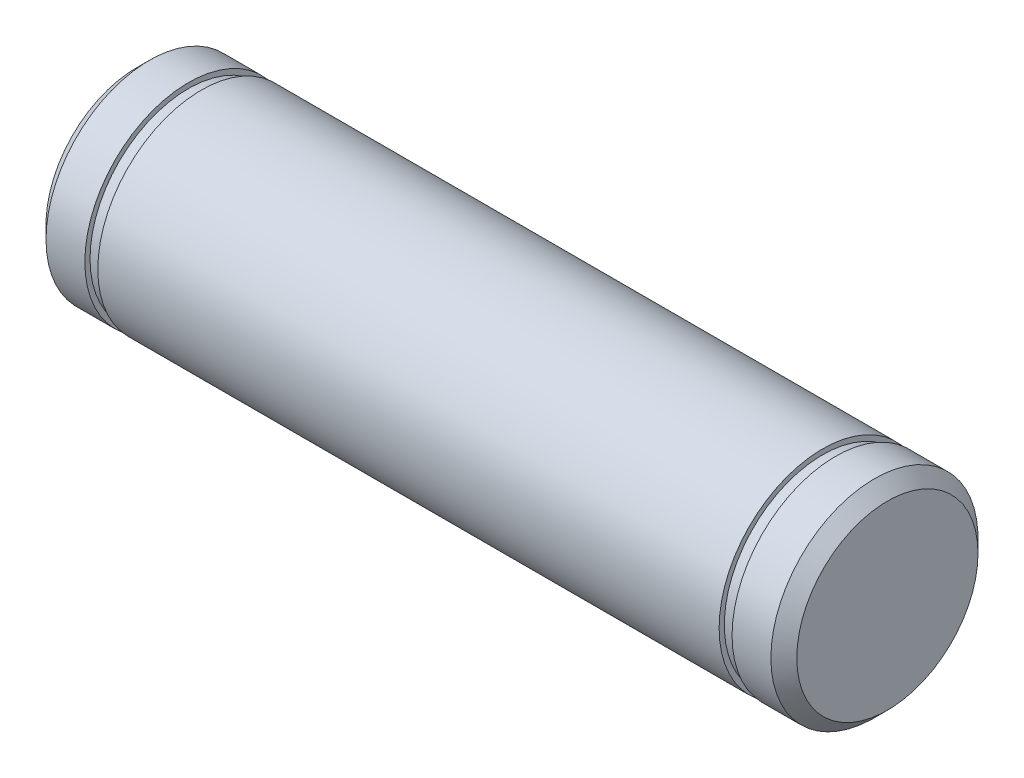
from build123d import *

# Parameters (mm, degrees)
SKETCH1_R           = 2
BOSS_EXTRUDE1_DEPTH = 14.5
CUT_EXTRUDE2_START  = -1
SKETCH2_R           = 2.498108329
SKETCH2_R_2         = 1.9
CUT_EXTRUDE2_DEPTH  = 0.25
CUT_EXTRUDE3_START  = -1.25
SKETCH3_R           = 2.5
SKETCH3_R_2         = 1.9
CUT_EXTRUDE3_DEPTH  = 0.25
CHAMFER1_SIZE       = 0.25


with BuildPart() as part:
    # Sketch1 → Boss-Extrude1 (new body)
    with BuildSketch(Plane(origin=(0, 0, 0), x_dir=(0, 0, -1), z_dir=(1, 0, 0))):
        with Locations(Location((0, 0, 0), (0, 0, 180))):
            Circle(SKETCH1_R)
    extrude(amount=BOSS_EXTRUDE1_DEPTH)

    # Sketch2 → Cut-Extrude2 (cut)
    with BuildSketch(Plane(origin=(14.5, 0, 0), x_dir=(0, 0, -1), z_dir=(1, 0, 0)).offset(CUT_EXTRUDE2_START)):
        Circle(SKETCH2_R)
        Circle(SKETCH2_R_2, mode=Mode.SUBTRACT)
    extrude(amount=-CUT_EXTRUDE2_DEPTH, mode=Mode.SUBTRACT)

    # Sketch3 → Cut-Extrude3 (cut)
    with BuildSketch(Plane.ZY.offset(CUT_EXTRUDE3_START)):
        Circle(SKETCH3_R)
        with Locations(Location((0, 0, 0), (0, 0, 180))):
            Circle(SKETCH3_R_2, mode=Mode.SUBTRACT)
    extrude(amount=CUT_EXTRUDE3_DEPTH, mode=Mode.SUBTRACT)

    # Chamfer1
    chamfer1_edges = [part.edges().sort_by_distance(p)[0] for p in [
        (0, 0, -2),
        (14.5, 0, -2),
    ]]
    chamfer(chamfer1_edges, length=CHAMFER1_SIZE)


solid = part.part
